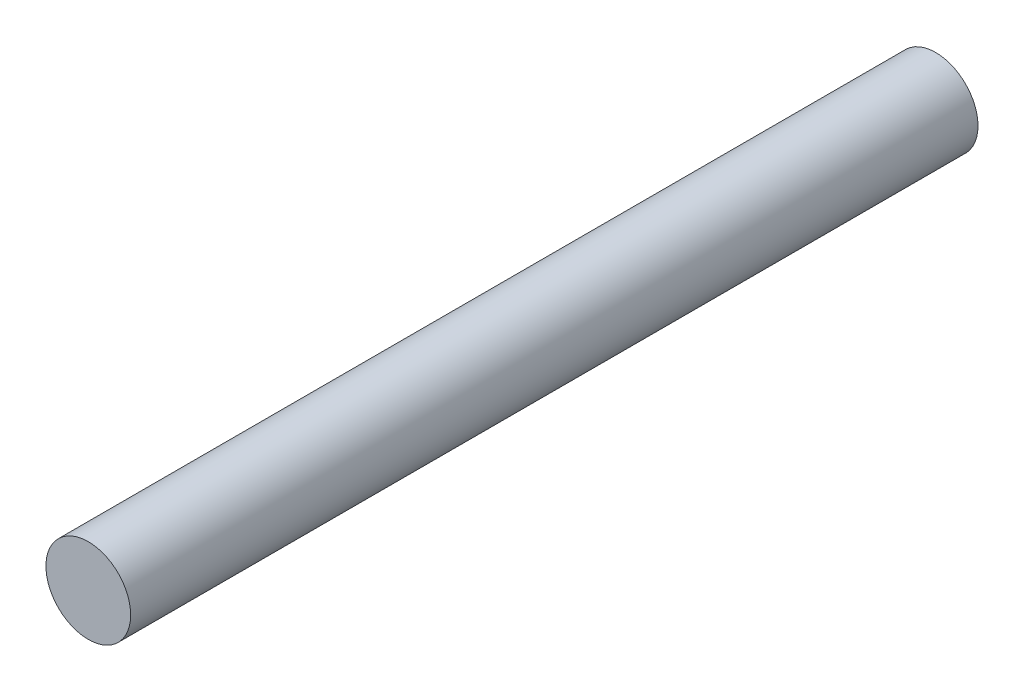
from build123d import *

# Parameters (mm, degrees)
SKETCH1_R           = 30
BOSS_EXTRUDE1_DEPTH = 600


with BuildPart() as part:
    # Sketch1 → Boss-Extrude1 (new body)
    with BuildSketch(Plane.XY):
        Circle(SKETCH1_R)
    extrude(amount=-BOSS_EXTRUDE1_DEPTH)


solid = part.part
